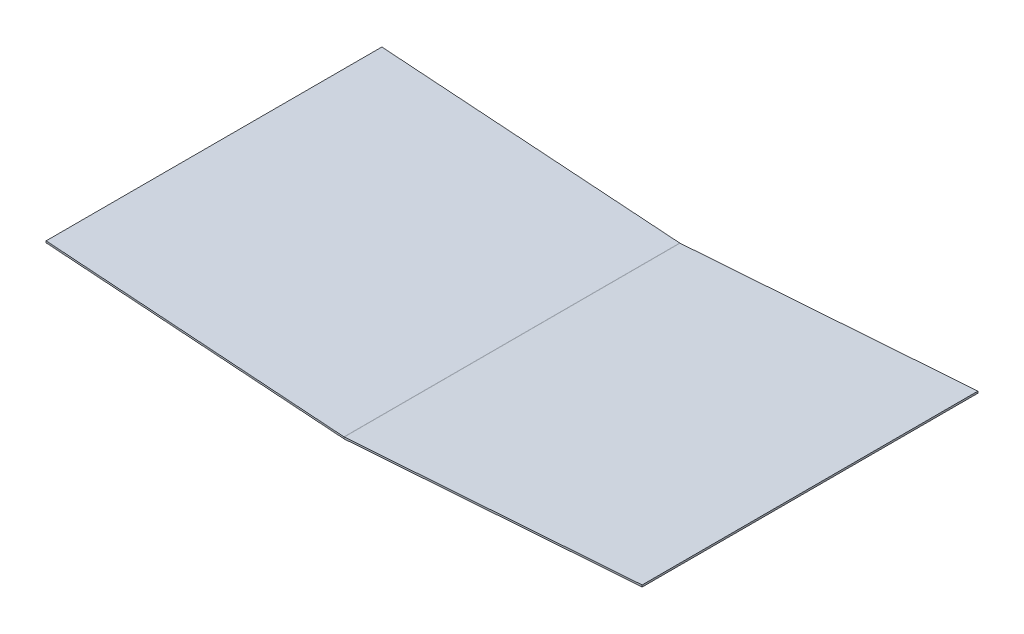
ISO-10303-21;
HEADER;
FILE_DESCRIPTION(('STEP AP214'),'2;1');
FILE_NAME('part.step','',(''),(''),'','','');
FILE_SCHEMA(('AUTOMOTIVE_DESIGN { 1 0 10303 214 1 1 1 1 }'));
ENDSEC;
DATA;
#1=APPLICATION_CONTEXT('core data for automotive mechanical design processes');
#2=APPLICATION_PROTOCOL_DEFINITION('international standard','automotive_design',2000,#1);
#3=PRODUCT_CONTEXT('',#1,'mechanical');
#4=PRODUCT('Part','Part','',(#3));
#5=PRODUCT_RELATED_PRODUCT_CATEGORY('part','',(#4));
#6=PRODUCT_DEFINITION_FORMATION('','',#4);
#7=PRODUCT_DEFINITION_CONTEXT('part definition',#1,'design');
#8=PRODUCT_DEFINITION('design','',#6,#7);
#9=PRODUCT_DEFINITION_SHAPE('','',#8);
#10=(LENGTH_UNIT() NAMED_UNIT(*) SI_UNIT(.MILLI.,.METRE.));
#11=(NAMED_UNIT(*) PLANE_ANGLE_UNIT() SI_UNIT($,.RADIAN.));
#12=(NAMED_UNIT(*) SI_UNIT($,.STERADIAN.) SOLID_ANGLE_UNIT());
#13=UNCERTAINTY_MEASURE_WITH_UNIT(LENGTH_MEASURE(1.E-05),#10,'distance_accuracy_value','');
#14=(GEOMETRIC_REPRESENTATION_CONTEXT(3) GLOBAL_UNCERTAINTY_ASSIGNED_CONTEXT((#13)) GLOBAL_UNIT_ASSIGNED_CONTEXT((#10,
#11,#12)) REPRESENTATION_CONTEXT('',''));
#15=CARTESIAN_POINT('',(0.,0.,0.));
#16=DIRECTION('',(0.,0.,1.));
#17=DIRECTION('',(1.,0.,0.));
#18=AXIS2_PLACEMENT_3D('',#15,#16,#17);
#19=CARTESIAN_POINT('',(-0.885907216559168,0.0619486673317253,1219.2));
#20=DIRECTION('',(0.,0.,1.));
#21=DIRECTION('',(1.,0.,0.));
#22=AXIS2_PLACEMENT_3D('',#19,#20,#21);
#23=PLANE('',#22);
#24=DIRECTION('',(0.0697564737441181,0.997564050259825,0.));
#25=VECTOR('',#24,1.);
#26=CARTESIAN_POINT('',(-0.885907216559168,0.0619486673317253,1219.2));
#27=LINE('',#26,#25);
#28=CARTESIAN_POINT('',(-0.885907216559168,0.0619486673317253,1219.2));
#29=VERTEX_POINT('',#28);
#30=CARTESIAN_POINT('',(-0.442953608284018,6.39648038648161,1219.2));
#31=VERTEX_POINT('',#30);
#32=EDGE_CURVE('E11',#29,#31,#27,.T.);
#33=ORIENTED_EDGE('',*,*,#32,.F.);
#34=CARTESIAN_POINT('',(-8.91029871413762E-12,12.7310121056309,1219.2));
#35=DIRECTION('',(0.,0.,1.));
#36=DIRECTION('',(1.,0.,0.));
#37=AXIS2_PLACEMENT_3D('',#34,#35,#36);
#38=CIRCLE('',#37,12.7);
#39=CARTESIAN_POINT('',(0.885907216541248,0.0619486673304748,1219.2));
#40=VERTEX_POINT('',#39);
#41=EDGE_CURVE('E136',#40,#29,#38,.F.);
#42=ORIENTED_EDGE('',*,*,#41,.F.);
#43=DIRECTION('',(0.0697564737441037,-0.997564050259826,0.));
#44=VECTOR('',#43,1.);
#45=CARTESIAN_POINT('',(0.442953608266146,6.39648038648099,1219.2));
#46=LINE('',#45,#44);
#47=CARTESIAN_POINT('',(0.442953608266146,6.39648038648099,1219.2));
#48=VERTEX_POINT('',#47);
#49=EDGE_CURVE('E47',#48,#40,#46,.T.);
#50=ORIENTED_EDGE('',*,*,#49,.F.);
#51=CARTESIAN_POINT('',(-8.91029871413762E-12,12.7310121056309,1219.2));
#52=DIRECTION('',(0.,0.,-1.));
#53=DIRECTION('',(-1.,0.,0.));
#54=AXIS2_PLACEMENT_3D('',#51,#52,#53);
#55=CIRCLE('',#54,6.35);
#56=EDGE_CURVE('E188',#48,#31,#55,.T.);
#57=ORIENTED_EDGE('',*,*,#56,.T.);
#58=EDGE_LOOP('',(#33,#42,#50,#57));
#59=FACE_BOUND('',#58,.T.);
#60=ADVANCED_FACE('F39',(#59),#23,.T.);
#61=CARTESIAN_POINT('',(0.442953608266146,6.39648038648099,1219.2));
#62=DIRECTION('',(0.,0.,1.));
#63=DIRECTION('',(1.,0.,0.));
#64=AXIS2_PLACEMENT_3D('',#61,#62,#63);
#65=PLANE('',#64);
#66=DIRECTION('',(-0.997564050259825,0.0697564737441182,0.));
#67=VECTOR('',#66,1.);
#68=CARTESIAN_POINT('',(0.,0.,1219.2));
#69=LINE('',#68,#67);
#70=CARTESIAN_POINT('',(-1082.675,75.7080111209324,1219.2));
#71=VERTEX_POINT('',#70);
#72=EDGE_CURVE('E161',#29,#71,#69,.T.);
#73=ORIENTED_EDGE('',*,*,#72,.F.);
#74=ORIENTED_EDGE('',*,*,#32,.T.);
#75=DIRECTION('',(-0.997564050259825,0.0697564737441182,0.));
#76=VECTOR('',#75,1.);
#77=CARTESIAN_POINT('',(0.44295360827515,6.33453171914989,1219.2));
#78=LINE('',#77,#76);
#79=CARTESIAN_POINT('',(-1082.23204639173,82.0425428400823,1219.2));
#80=VERTEX_POINT('',#79);
#81=EDGE_CURVE('E204',#31,#80,#78,.T.);
#82=ORIENTED_EDGE('',*,*,#81,.T.);
#83=DIRECTION('',(-0.0697564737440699,-0.997564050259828,0.));
#84=VECTOR('',#83,1.);
#85=CARTESIAN_POINT('',(-1082.23204639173,82.0425428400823,1219.2));
#86=LINE('',#85,#84);
#87=EDGE_CURVE('E98',#80,#71,#86,.T.);
#88=ORIENTED_EDGE('',*,*,#87,.T.);
#89=EDGE_LOOP('',(#73,#74,#82,#88));
#90=FACE_BOUND('',#89,.T.);
#91=ADVANCED_FACE('F209',(#90),#65,.T.);
#92=CARTESIAN_POINT('',(0.885907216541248,0.0619486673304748,0.));
#93=DIRECTION('',(0.,0.,-1.));
#94=DIRECTION('',(-1.,0.,0.));
#95=AXIS2_PLACEMENT_3D('',#92,#93,#94);
#96=PLANE('',#95);
#97=DIRECTION('',(-0.0697564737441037,0.997564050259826,0.));
#98=VECTOR('',#97,1.);
#99=CARTESIAN_POINT('',(0.885907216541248,0.0619486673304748,0.));
#100=LINE('',#99,#98);
#101=CARTESIAN_POINT('',(0.885907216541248,0.0619486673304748,0.));
#102=VERTEX_POINT('',#101);
#103=CARTESIAN_POINT('',(0.442953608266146,6.39648038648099,0.));
#104=VERTEX_POINT('',#103);
#105=EDGE_CURVE('E82',#102,#104,#100,.T.);
#106=ORIENTED_EDGE('',*,*,#105,.F.);
#107=CARTESIAN_POINT('',(-8.91029871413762E-12,12.7310121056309,0.));
#108=DIRECTION('',(0.,0.,1.));
#109=DIRECTION('',(1.,0.,0.));
#110=AXIS2_PLACEMENT_3D('',#107,#108,#109);
#111=CIRCLE('',#110,12.7);
#112=CARTESIAN_POINT('',(-0.885907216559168,0.0619486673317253,0.));
#113=VERTEX_POINT('',#112);
#114=EDGE_CURVE('E159',#102,#113,#111,.F.);
#115=ORIENTED_EDGE('',*,*,#114,.T.);
#116=DIRECTION('',(-0.0697564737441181,-0.997564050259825,0.));
#117=VECTOR('',#116,1.);
#118=CARTESIAN_POINT('',(-0.442953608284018,6.39648038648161,0.));
#119=LINE('',#118,#117);
#120=CARTESIAN_POINT('',(-0.442953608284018,6.39648038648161,0.));
#121=VERTEX_POINT('',#120);
#122=EDGE_CURVE('E89',#121,#113,#119,.T.);
#123=ORIENTED_EDGE('',*,*,#122,.F.);
#124=CARTESIAN_POINT('',(-8.91029871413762E-12,12.7310121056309,0.));
#125=DIRECTION('',(0.,0.,-1.));
#126=DIRECTION('',(-1.,0.,0.));
#127=AXIS2_PLACEMENT_3D('',#124,#125,#126);
#128=CIRCLE('',#127,6.35);
#129=EDGE_CURVE('E150',#104,#121,#128,.T.);
#130=ORIENTED_EDGE('',*,*,#129,.F.);
#131=EDGE_LOOP('',(#106,#115,#123,#130));
#132=FACE_BOUND('',#131,.T.);
#133=ADVANCED_FACE('F189',(#132),#96,.T.);
#134=CARTESIAN_POINT('',(-0.442953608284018,6.39648038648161,0.));
#135=DIRECTION('',(0.,0.,-1.));
#136=DIRECTION('',(-1.,0.,0.));
#137=AXIS2_PLACEMENT_3D('',#134,#135,#136);
#138=PLANE('',#137);
#139=DIRECTION('',(-0.997564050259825,-0.0697564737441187,0.));
#140=VECTOR('',#139,1.);
#141=CARTESIAN_POINT('',(1082.675,75.7080111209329,0.));
#142=LINE('',#141,#140);
#143=CARTESIAN_POINT('',(1082.675,75.7080111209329,0.));
#144=VERTEX_POINT('',#143);
#145=EDGE_CURVE('E119',#144,#102,#142,.T.);
#146=ORIENTED_EDGE('',*,*,#145,.T.);
#147=ORIENTED_EDGE('',*,*,#105,.T.);
#148=DIRECTION('',(-0.997564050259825,-0.0697564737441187,0.));
#149=VECTOR('',#148,1.);
#150=CARTESIAN_POINT('',(1082.23204639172,82.0425428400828,0.));
#151=LINE('',#150,#149);
#152=CARTESIAN_POINT('',(1082.23204639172,82.0425428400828,0.));
#153=VERTEX_POINT('',#152);
#154=EDGE_CURVE('E153',#153,#104,#151,.T.);
#155=ORIENTED_EDGE('',*,*,#154,.F.);
#156=DIRECTION('',(-0.0697564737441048,0.997564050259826,0.));
#157=VECTOR('',#156,1.);
#158=CARTESIAN_POINT('',(1082.675,75.7080111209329,0.));
#159=LINE('',#158,#157);
#160=EDGE_CURVE('E156',#144,#153,#159,.T.);
#161=ORIENTED_EDGE('',*,*,#160,.F.);
#162=EDGE_LOOP('',(#146,#147,#155,#161));
#163=FACE_BOUND('',#162,.T.);
#164=ADVANCED_FACE('F179',(#163),#138,.T.);
#165=CARTESIAN_POINT('',(0.,0.,1219.2));
#166=DIRECTION('',(-0.0697564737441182,-0.997564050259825,0.));
#167=DIRECTION('',(0.997564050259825,-0.0697564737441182,0.));
#168=AXIS2_PLACEMENT_3D('',#165,#166,#167);
#169=PLANE('',#168);
#170=DIRECTION('',(-0.997564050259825,0.0697564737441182,0.));
#171=VECTOR('',#170,1.);
#172=CARTESIAN_POINT('',(0.,0.,0.));
#173=LINE('',#172,#171);
#174=CARTESIAN_POINT('',(-1082.675,75.7080111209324,0.));
#175=VERTEX_POINT('',#174);
#176=EDGE_CURVE('E143',#113,#175,#173,.T.);
#177=ORIENTED_EDGE('',*,*,#176,.F.);
#178=DIRECTION('',(0.,0.,-1.));
#179=VECTOR('',#178,1.);
#180=CARTESIAN_POINT('',(-0.885907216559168,0.0619486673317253,1219.2));
#181=LINE('',#180,#179);
#182=EDGE_CURVE('E162',#29,#113,#181,.T.);
#183=ORIENTED_EDGE('',*,*,#182,.F.);
#184=ORIENTED_EDGE('',*,*,#72,.T.);
#185=DIRECTION('',(0.,0.,-1.));
#186=VECTOR('',#185,1.);
#187=CARTESIAN_POINT('',(-1082.675,75.7080111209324,1219.2));
#188=LINE('',#187,#186);
#189=EDGE_CURVE('E139',#71,#175,#188,.T.);
#190=ORIENTED_EDGE('',*,*,#189,.T.);
#191=EDGE_LOOP('',(#177,#183,#184,#190));
#192=FACE_BOUND('',#191,.T.);
#193=ADVANCED_FACE('F195',(#192),#169,.T.);
#194=CARTESIAN_POINT('',(-8.91029871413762E-12,12.7310121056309,1219.2));
#195=DIRECTION('',(0.,0.,-1.));
#196=DIRECTION('',(-1.,0.,0.));
#197=AXIS2_PLACEMENT_3D('',#194,#195,#196);
#198=CYLINDRICAL_SURFACE('',#197,12.7);
#199=ORIENTED_EDGE('',*,*,#114,.F.);
#200=DIRECTION('',(0.,0.,-1.));
#201=VECTOR('',#200,1.);
#202=CARTESIAN_POINT('',(0.885907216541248,0.0619486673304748,1219.2));
#203=LINE('',#202,#201);
#204=EDGE_CURVE('E122',#40,#102,#203,.T.);
#205=ORIENTED_EDGE('',*,*,#204,.F.);
#206=ORIENTED_EDGE('',*,*,#41,.T.);
#207=ORIENTED_EDGE('',*,*,#182,.T.);
#208=EDGE_LOOP('',(#199,#205,#206,#207));
#209=FACE_BOUND('',#208,.T.);
#210=ADVANCED_FACE('F191',(#209),#198,.T.);
#211=CARTESIAN_POINT('',(1082.675,75.7080111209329,1219.2));
#212=DIRECTION('',(0.0697564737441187,-0.997564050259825,0.));
#213=DIRECTION('',(0.997564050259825,0.0697564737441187,0.));
#214=AXIS2_PLACEMENT_3D('',#211,#212,#213);
#215=PLANE('',#214);
#216=ORIENTED_EDGE('',*,*,#145,.F.);
#217=DIRECTION('',(0.,0.,-1.));
#218=VECTOR('',#217,1.);
#219=CARTESIAN_POINT('',(1082.675,75.7080111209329,1219.2));
#220=LINE('',#219,#218);
#221=CARTESIAN_POINT('',(1082.675,75.7080111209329,1219.2));
#222=VERTEX_POINT('',#221);
#223=EDGE_CURVE('E113',#222,#144,#220,.T.);
#224=ORIENTED_EDGE('',*,*,#223,.F.);
#225=DIRECTION('',(-0.997564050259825,-0.0697564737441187,0.));
#226=VECTOR('',#225,1.);
#227=CARTESIAN_POINT('',(1082.675,75.7080111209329,1219.2));
#228=LINE('',#227,#226);
#229=EDGE_CURVE('E117',#222,#40,#228,.T.);
#230=ORIENTED_EDGE('',*,*,#229,.T.);
#231=ORIENTED_EDGE('',*,*,#204,.T.);
#232=EDGE_LOOP('',(#216,#224,#230,#231));
#233=FACE_BOUND('',#232,.T.);
#234=ADVANCED_FACE('F115',(#233),#215,.T.);
#235=CARTESIAN_POINT('',(1082.675,75.7080111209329,1219.2));
#236=DIRECTION('',(-0.997564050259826,-0.0697564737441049,0.));
#237=DIRECTION('',(0.0697564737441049,-0.997564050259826,0.));
#238=AXIS2_PLACEMENT_3D('',#235,#236,#237);
#239=PLANE('',#238);
#240=ORIENTED_EDGE('',*,*,#160,.T.);
#241=DIRECTION('',(0.,0.,-1.));
#242=VECTOR('',#241,1.);
#243=CARTESIAN_POINT('',(1082.23204639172,82.0425428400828,1219.2));
#244=LINE('',#243,#242);
#245=CARTESIAN_POINT('',(1082.23204639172,82.0425428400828,1219.2));
#246=VERTEX_POINT('',#245);
#247=EDGE_CURVE('E123',#246,#153,#244,.T.);
#248=ORIENTED_EDGE('',*,*,#247,.F.);
#249=DIRECTION('',(-0.0697564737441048,0.997564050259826,0.));
#250=VECTOR('',#249,1.);
#251=CARTESIAN_POINT('',(1082.675,75.7080111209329,1219.2));
#252=LINE('',#251,#250);
#253=EDGE_CURVE('E126',#222,#246,#252,.T.);
#254=ORIENTED_EDGE('',*,*,#253,.F.);
#255=ORIENTED_EDGE('',*,*,#223,.T.);
#256=EDGE_LOOP('',(#240,#248,#254,#255));
#257=FACE_BOUND('',#256,.T.);
#258=ADVANCED_FACE('F127',(#257),#239,.F.);
#259=CARTESIAN_POINT('',(1082.23204639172,82.0425428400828,1219.2));
#260=DIRECTION('',(0.0697564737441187,-0.997564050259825,0.));
#261=DIRECTION('',(0.997564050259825,0.0697564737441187,0.));
#262=AXIS2_PLACEMENT_3D('',#259,#260,#261);
#263=PLANE('',#262);
#264=ORIENTED_EDGE('',*,*,#154,.T.);
#265=DIRECTION('',(0.,0.,-1.));
#266=VECTOR('',#265,1.);
#267=CARTESIAN_POINT('',(0.442953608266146,6.39648038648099,1219.2));
#268=LINE('',#267,#266);
#269=EDGE_CURVE('E166',#48,#104,#268,.T.);
#270=ORIENTED_EDGE('',*,*,#269,.F.);
#271=DIRECTION('',(-0.997564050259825,-0.0697564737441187,0.));
#272=VECTOR('',#271,1.);
#273=CARTESIAN_POINT('',(1082.23204639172,82.0425428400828,1219.2));
#274=LINE('',#273,#272);
#275=EDGE_CURVE('E132',#246,#48,#274,.T.);
#276=ORIENTED_EDGE('',*,*,#275,.F.);
#277=ORIENTED_EDGE('',*,*,#247,.T.);
#278=EDGE_LOOP('',(#264,#270,#276,#277));
#279=FACE_BOUND('',#278,.T.);
#280=ADVANCED_FACE('F183',(#279),#263,.F.);
#281=CARTESIAN_POINT('',(-8.91029871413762E-12,12.7310121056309,1219.2));
#282=DIRECTION('',(0.,0.,-1.));
#283=DIRECTION('',(-1.,0.,0.));
#284=AXIS2_PLACEMENT_3D('',#281,#282,#283);
#285=CYLINDRICAL_SURFACE('',#284,6.35);
#286=ORIENTED_EDGE('',*,*,#129,.T.);
#287=DIRECTION('',(0.,0.,-1.));
#288=VECTOR('',#287,1.);
#289=CARTESIAN_POINT('',(-0.442953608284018,6.39648038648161,1219.2));
#290=LINE('',#289,#288);
#291=EDGE_CURVE('E169',#31,#121,#290,.T.);
#292=ORIENTED_EDGE('',*,*,#291,.F.);
#293=ORIENTED_EDGE('',*,*,#56,.F.);
#294=ORIENTED_EDGE('',*,*,#269,.T.);
#295=EDGE_LOOP('',(#286,#292,#293,#294));
#296=FACE_BOUND('',#295,.T.);
#297=ADVANCED_FACE('F186',(#296),#285,.F.);
#298=CARTESIAN_POINT('',(0.44295360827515,6.33453171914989,1219.2));
#299=DIRECTION('',(-0.0697564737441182,-0.997564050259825,0.));
#300=DIRECTION('',(0.997564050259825,-0.0697564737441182,0.));
#301=AXIS2_PLACEMENT_3D('',#298,#299,#300);
#302=PLANE('',#301);
#303=DIRECTION('',(-0.997564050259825,0.0697564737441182,0.));
#304=VECTOR('',#303,1.);
#305=CARTESIAN_POINT('',(0.44295360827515,6.33453171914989,0.));
#306=LINE('',#305,#304);
#307=CARTESIAN_POINT('',(-1082.23204639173,82.0425428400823,0.));
#308=VERTEX_POINT('',#307);
#309=EDGE_CURVE('E148',#121,#308,#306,.T.);
#310=ORIENTED_EDGE('',*,*,#309,.T.);
#311=DIRECTION('',(0.,0.,-1.));
#312=VECTOR('',#311,1.);
#313=CARTESIAN_POINT('',(-1082.23204639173,82.0425428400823,1219.2));
#314=LINE('',#313,#312);
#315=EDGE_CURVE('E172',#80,#308,#314,.T.);
#316=ORIENTED_EDGE('',*,*,#315,.F.);
#317=ORIENTED_EDGE('',*,*,#81,.F.);
#318=ORIENTED_EDGE('',*,*,#291,.T.);
#319=EDGE_LOOP('',(#310,#316,#317,#318));
#320=FACE_BOUND('',#319,.T.);
#321=ADVANCED_FACE('F203',(#320),#302,.F.);
#322=CARTESIAN_POINT('',(-1082.23204639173,82.0425428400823,1219.2));
#323=DIRECTION('',(0.997564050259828,-0.0697564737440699,0.));
#324=DIRECTION('',(0.0697564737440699,0.997564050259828,0.));
#325=AXIS2_PLACEMENT_3D('',#322,#323,#324);
#326=PLANE('',#325);
#327=DIRECTION('',(-0.0697564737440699,-0.997564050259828,0.));
#328=VECTOR('',#327,1.);
#329=CARTESIAN_POINT('',(-1082.23204639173,82.0425428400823,0.));
#330=LINE('',#329,#328);
#331=EDGE_CURVE('E145',#308,#175,#330,.T.);
#332=ORIENTED_EDGE('',*,*,#331,.T.);
#333=ORIENTED_EDGE('',*,*,#189,.F.);
#334=ORIENTED_EDGE('',*,*,#87,.F.);
#335=ORIENTED_EDGE('',*,*,#315,.T.);
#336=EDGE_LOOP('',(#332,#333,#334,#335));
#337=FACE_BOUND('',#336,.T.);
#338=ADVANCED_FACE('F199',(#337),#326,.F.);
#339=CARTESIAN_POINT('',(-8.91029871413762E-12,12.7310121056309,1219.2));
#340=DIRECTION('',(0.,0.,-1.));
#341=DIRECTION('',(-1.,0.,0.));
#342=AXIS2_PLACEMENT_3D('',#339,#340,#341);
#343=PLANE('',#342);
#344=ORIENTED_EDGE('',*,*,#275,.T.);
#345=ORIENTED_EDGE('',*,*,#49,.T.);
#346=ORIENTED_EDGE('',*,*,#229,.F.);
#347=ORIENTED_EDGE('',*,*,#253,.T.);
#348=EDGE_LOOP('',(#344,#345,#346,#347));
#349=FACE_BOUND('',#348,.T.);
#350=ADVANCED_FACE('F134',(#349),#343,.F.);
#351=CARTESIAN_POINT('',(-8.91029871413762E-12,12.7310121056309,0.));
#352=DIRECTION('',(0.,0.,-1.));
#353=DIRECTION('',(-1.,0.,0.));
#354=AXIS2_PLACEMENT_3D('',#351,#352,#353);
#355=PLANE('',#354);
#356=ORIENTED_EDGE('',*,*,#176,.T.);
#357=ORIENTED_EDGE('',*,*,#331,.F.);
#358=ORIENTED_EDGE('',*,*,#309,.F.);
#359=ORIENTED_EDGE('',*,*,#122,.T.);
#360=EDGE_LOOP('',(#356,#357,#358,#359));
#361=FACE_BOUND('',#360,.T.);
#362=ADVANCED_FACE('F197',(#361),#355,.T.);
#363=CLOSED_SHELL('',(#60,#91,#133,#164,#193,#210,#234,#258,#280,#297,#321,#338,#350,#362));
#364=MANIFOLD_SOLID_BREP('B2',#363);
#365=ADVANCED_BREP_SHAPE_REPRESENTATION('',(#18,#364),#14);
#366=SHAPE_DEFINITION_REPRESENTATION(#9,#365);
ENDSEC;
END-ISO-10303-21;
